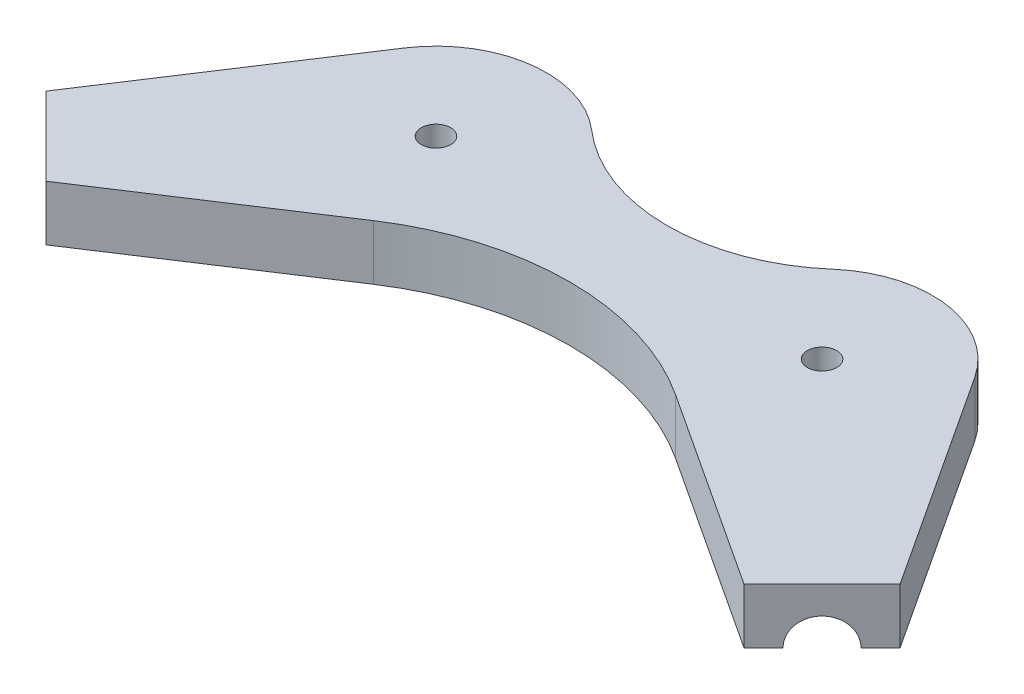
from build123d import *

# Parameters (mm, degrees)
CROQUIS1_R              = 4
SALIENTE_EXTRUIR1_DEPTH = 15
CROQUIS2_R              = 7.5
CORTAR_EXTRUIR1_DEPTH   = 30
CROQUIS3_R              = 7.5
CORTAR_EXTRUIR2_DEPTH   = 30


with BuildPart() as part:
    # Croquis1 → Saliente-Extruir1 (new body)
    with BuildSketch(Plane(origin=(0, 0, 0), x_dir=(1, 0, 0), z_dir=(0, 1, 0))):
        with BuildLine():
            Line((21419.298196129, 4422.623704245), (21398.084992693, 4443.836907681))
            Line((21398.084992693, 4443.836907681), (21436.62639469, 4502.697423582))
            ThreePointArc((21436.62639469, 4502.697423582), (21457.609295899, 4515.979711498), (21481.412103, 4508.899620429))
            ThreePointArc((21481.412103, 4508.899620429), (21514.224603, 4496.62679689), (21547.037103, 4508.899620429))
            ThreePointArc((21547.037103, 4508.899620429), (21570.839910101, 4515.979711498), (21591.822811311, 4502.697423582))
            Line((21591.822811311, 4502.697423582), (21630.364213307, 4443.836907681))
            Line((21630.364213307, 4443.836907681), (21609.151009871, 4422.623704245))
            Line((21609.151009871, 4422.623704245), (21555.309875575, 4457.878454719))
            ThreePointArc((21555.309875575, 4457.878454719), (21514.224603, 4470.132933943), (21473.139330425, 4457.878454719))
            Line((21473.139330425, 4457.878454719), (21419.298196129, 4422.623704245))
        make_face()
        with Locations(Location((21461.724603, 4486.263314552, 0), (0, 0, 270))):
            Circle(CROQUIS1_R, mode=Mode.SUBTRACT)
        with Locations(Location((21566.724603, 4486.263314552, 0), (0, 0, 270))):
            Circle(CROQUIS1_R, mode=Mode.SUBTRACT)
    extrude(amount=SALIENTE_EXTRUIR1_DEPTH)

    # Croquis2 → Cortar-Extruir1 (cut)
    with BuildSketch(Plane(origin=(12920.960950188, 0, -12920.960950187), x_dir=(0.707106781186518, 0, 0.707106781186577), z_dir=(-0.707106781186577, 0, 0.707106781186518))):
        with Locations((12003.463790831, 0)):
            Circle(CROQUIS2_R)
    extrude(amount=-CORTAR_EXTRUIR1_DEPTH, mode=Mode.SUBTRACT)

    # Croquis3 → Cortar-Extruir2 (cut)
    with BuildSketch(Plane(origin=(8593.263652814, 0, 8593.263652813), x_dir=(0.707106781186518, 0, -0.707106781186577), z_dir=(0.707106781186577, 0, 0.707106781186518))):
        with Locations((18422.244426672, 0)):
            Circle(CROQUIS3_R)
    extrude(amount=-CORTAR_EXTRUIR2_DEPTH, mode=Mode.SUBTRACT)


solid = part.part
